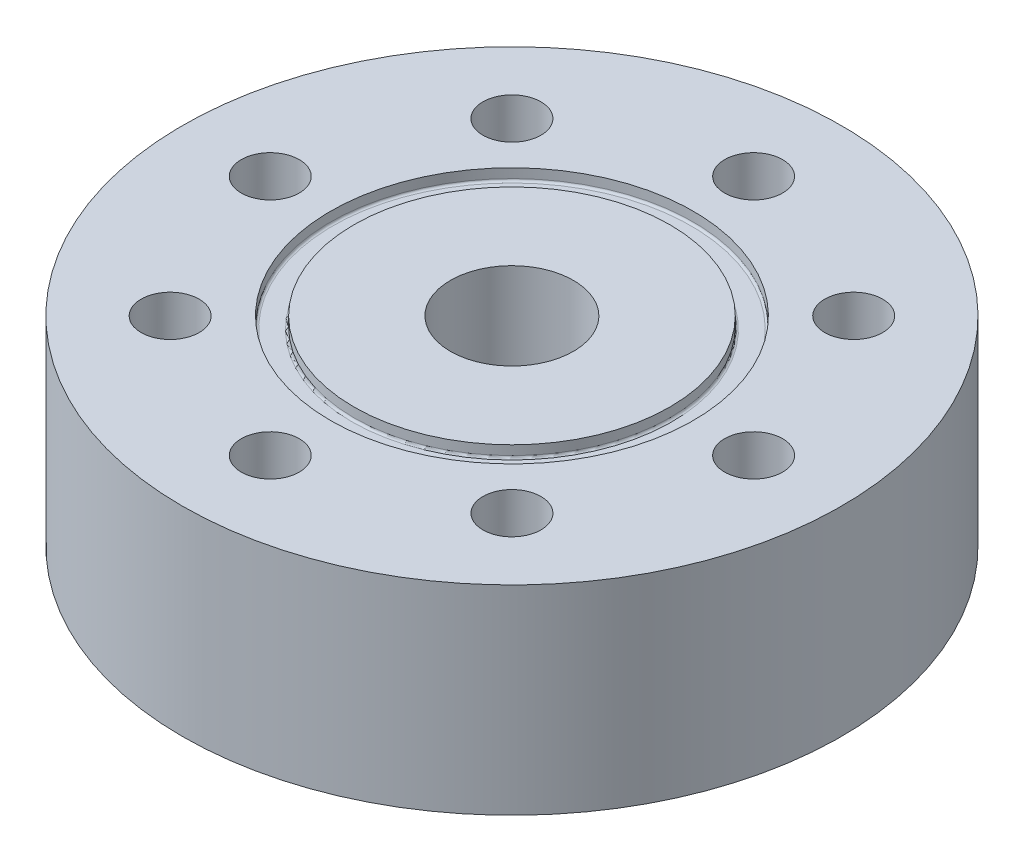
from build123d import *

# Parameters (mm, degrees)
SKETCH2_R                 = 37.5
OUTER_CYLINDER_DEPTH      = 22.7
SKETCH3_R                 = 8.93
NPT_HOLE_DEPTH            = 12.7
SKETCH4_R                 = 3.3
BOLT_HOLES_DEPTH          = 58.687000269
SKETCH5_R                 = 20.6375
SKETCH5_R_2               = 17.9705
O_RING_GROOVE_DEPTH       = 1.3208
FILLET1_R                 = 0.254
SKETCH6_R                 = 7
INLET_FLOW_DIAMETER_DEPTH = 10


with BuildPart() as part:
    # Sketch2 → Outer Cylinder (new body)
    with BuildSketch(Plane(origin=(0, 0, 0), x_dir=(1, 0, 0), z_dir=(0, 1, 0))):
        with Locations(Location((0, 0, 0), (0, 0, 270))):
            Circle(SKETCH2_R)
    extrude(amount=OUTER_CYLINDER_DEPTH)

    # Sketch3 → NPT Hole (cut)
    with BuildSketch(Plane.XZ):
        with Locations(Location((0, 0, 0), (0, 0, 270))):
            Circle(SKETCH3_R)
    extrude(amount=-NPT_HOLE_DEPTH, mode=Mode.SUBTRACT)

    # Sketch4 → Bolt Holes (cut, through all)
    with BuildSketch(Plane.XZ):
        with Locations(Location((-27.5, 0, 0), (0, 0, 270))):
            Circle(SKETCH4_R)
        with Locations(Location((-19.445436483, 19.445436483, 0), (0, 0, 270))):
            Circle(SKETCH4_R)
        with Locations(Location((0, 27.5, 0), (0, 0, 270))):
            Circle(SKETCH4_R)
        with Locations(Location((19.445436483, 19.445436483, 0), (0, 0, 270))):
            Circle(SKETCH4_R)
        with Locations(Location((27.5, 0, 0), (0, 0, 270))):
            Circle(SKETCH4_R)
        with Locations(Location((19.445436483, -19.445436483, 0), (0, 0, 270))):
            Circle(SKETCH4_R)
        with Locations(Location((0, -27.5, 0), (0, 0, 270))):
            Circle(SKETCH4_R)
        with Locations(Location((-19.445436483, -19.445436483, 0), (0, 0, 270))):
            Circle(SKETCH4_R)
    extrude(amount=-BOLT_HOLES_DEPTH, mode=Mode.SUBTRACT)

    # Sketch5 → O-Ring Groove (cut)
    with BuildSketch(Plane(origin=(0, 22.7, 0), x_dir=(1, 0, 0), z_dir=(0, 1, 0))):
        with Locations(Location((0, 0, 0), (0, 0, 270))):
            Circle(SKETCH5_R)
        with Locations(Location((0, 0, 0), (0, 0, 270))):
            Circle(SKETCH5_R_2, mode=Mode.SUBTRACT)
    extrude(amount=-O_RING_GROOVE_DEPTH, mode=Mode.SUBTRACT)

    # Fillet1
    fillet1_edges = [part.edges().sort_by_distance(p)[0] for p in [
        (0, 21.3792, -20.6375),
        (0, 21.3792, -17.9705),
    ]]
    fillet(fillet1_edges, radius=FILLET1_R)

    # Sketch6 → Inlet Flow Diameter (cut)
    with BuildSketch(Plane(origin=(0, 22.7, 0), x_dir=(1, 0, 0), z_dir=(0, 1, 0))):
        with Locations(Location((0, 0, 0), (0, 0, 270))):
            Circle(SKETCH6_R)
    extrude(amount=-INLET_FLOW_DIAMETER_DEPTH, mode=Mode.SUBTRACT)


solid = part.part
